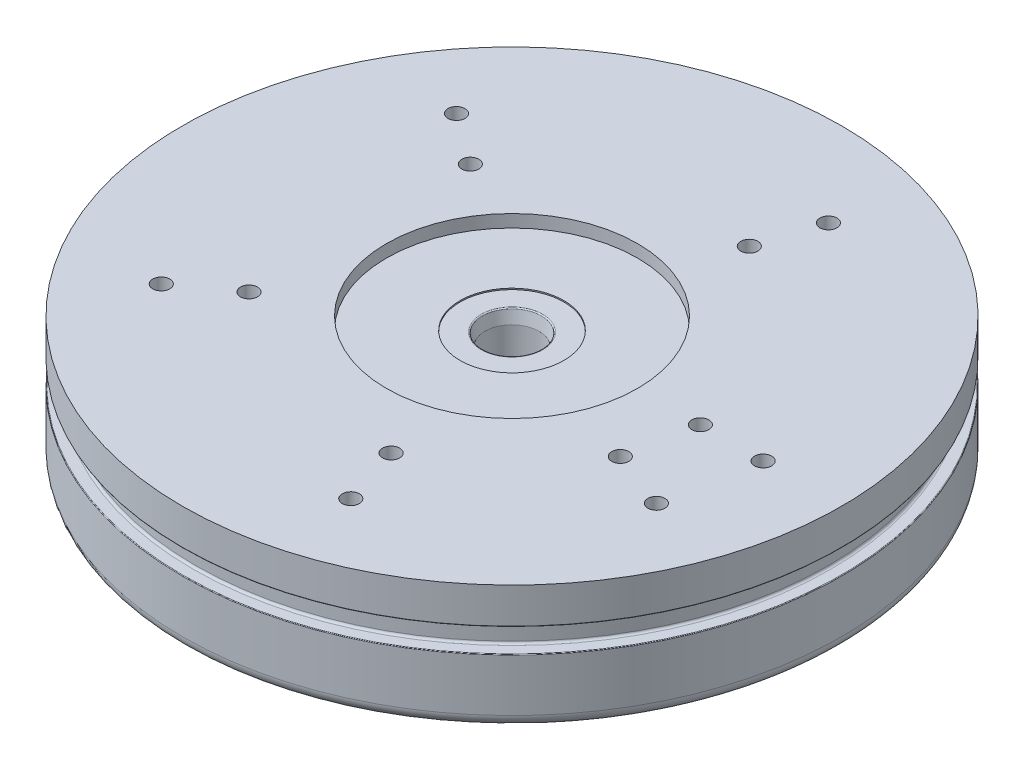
ISO-10303-21;
HEADER;
FILE_DESCRIPTION(('STEP AP214'),'2;1');
FILE_NAME('part.step','',(''),(''),'','','');
FILE_SCHEMA(('AUTOMOTIVE_DESIGN { 1 0 10303 214 1 1 1 1 }'));
ENDSEC;
DATA;
#1=APPLICATION_CONTEXT('core data for automotive mechanical design processes');
#2=APPLICATION_PROTOCOL_DEFINITION('international standard','automotive_design',2000,#1);
#3=PRODUCT_CONTEXT('',#1,'mechanical');
#4=PRODUCT('Part','Part','',(#3));
#5=PRODUCT_RELATED_PRODUCT_CATEGORY('part','',(#4));
#6=PRODUCT_DEFINITION_FORMATION('','',#4);
#7=PRODUCT_DEFINITION_CONTEXT('part definition',#1,'design');
#8=PRODUCT_DEFINITION('design','',#6,#7);
#9=PRODUCT_DEFINITION_SHAPE('','',#8);
#10=(LENGTH_UNIT() NAMED_UNIT(*) SI_UNIT(.MILLI.,.METRE.));
#11=(NAMED_UNIT(*) PLANE_ANGLE_UNIT() SI_UNIT($,.RADIAN.));
#12=(NAMED_UNIT(*) SI_UNIT($,.STERADIAN.) SOLID_ANGLE_UNIT());
#13=UNCERTAINTY_MEASURE_WITH_UNIT(LENGTH_MEASURE(1.E-05),#10,'distance_accuracy_value','');
#14=(GEOMETRIC_REPRESENTATION_CONTEXT(3) GLOBAL_UNCERTAINTY_ASSIGNED_CONTEXT((#13)) GLOBAL_UNIT_ASSIGNED_CONTEXT((#10,
#11,#12)) REPRESENTATION_CONTEXT('',''));
#15=CARTESIAN_POINT('',(0.,0.,0.));
#16=DIRECTION('',(0.,0.,1.));
#17=DIRECTION('',(1.,0.,0.));
#18=AXIS2_PLACEMENT_3D('',#15,#16,#17);
#19=CARTESIAN_POINT('',(-66.675,0.,0.));
#20=DIRECTION('',(0.,-1.,0.));
#21=DIRECTION('',(0.,0.,-1.));
#22=AXIS2_PLACEMENT_3D('',#19,#20,#21);
#23=PLANE('',#22);
#24=CARTESIAN_POINT('',(35.5694142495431,0.,13.6538188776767));
#25=DIRECTION('',(0.,1.,0.));
#26=DIRECTION('',(0.,0.,1.));
#27=AXIS2_PLACEMENT_3D('',#24,#25,#26);
#28=CIRCLE('',#27,1.72719999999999);
#29=CARTESIAN_POINT('',(35.5694142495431,0.,15.3810188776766));
#30=VERTEX_POINT('',#29);
#31=EDGE_CURVE('E94',#30,#30,#28,.T.);
#32=ORIENTED_EDGE('',*,*,#31,.F.);
#33=EDGE_LOOP('',(#32));
#34=FACE_BOUND('',#33,.T.);
#35=CARTESIAN_POINT('',(47.4258856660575,0.,18.2050918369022));
#36=DIRECTION('',(0.,1.,0.));
#37=DIRECTION('',(0.,0.,1.));
#38=AXIS2_PLACEMENT_3D('',#35,#36,#37);
#39=CIRCLE('',#38,1.72719999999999);
#40=CARTESIAN_POINT('',(47.4258856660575,0.,19.9322918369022));
#41=VERTEX_POINT('',#40);
#42=EDGE_CURVE('E93',#41,#41,#39,.T.);
#43=ORIENTED_EDGE('',*,*,#42,.F.);
#44=EDGE_LOOP('',(#43));
#45=FACE_BOUND('',#44,.T.);
#46=CARTESIAN_POINT('',(15.6980633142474,0.,-48.3136710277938));
#47=DIRECTION('',(0.,1.,0.));
#48=DIRECTION('',(0.,0.,1.));
#49=AXIS2_PLACEMENT_3D('',#46,#47,#48);
#50=CIRCLE('',#49,1.72719999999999);
#51=CARTESIAN_POINT('',(15.6980633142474,0.,-46.5864710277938));
#52=VERTEX_POINT('',#51);
#53=EDGE_CURVE('E110',#52,#52,#50,.T.);
#54=ORIENTED_EDGE('',*,*,#53,.F.);
#55=EDGE_LOOP('',(#54));
#56=FACE_BOUND('',#55,.T.);
#57=CARTESIAN_POINT('',(-30.8235474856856,0.,-22.3946181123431));
#58=DIRECTION('',(0.,1.,0.));
#59=DIRECTION('',(0.,0.,1.));
#60=AXIS2_PLACEMENT_3D('',#57,#58,#59);
#61=CIRCLE('',#60,1.72719999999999);
#62=CARTESIAN_POINT('',(-30.8235474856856,0.,-20.6674181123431));
#63=VERTEX_POINT('',#62);
#64=EDGE_CURVE('E116',#63,#63,#61,.T.);
#65=ORIENTED_EDGE('',*,*,#64,.F.);
#66=EDGE_LOOP('',(#65));
#67=FACE_BOUND('',#66,.T.);
#68=CARTESIAN_POINT('',(-41.0980633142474,0.,-29.8594908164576));
#69=DIRECTION('',(0.,1.,0.));
#70=DIRECTION('',(0.,0.,1.));
#71=AXIS2_PLACEMENT_3D('',#68,#69,#70);
#72=CIRCLE('',#71,1.72719999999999);
#73=CARTESIAN_POINT('',(-41.0980633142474,0.,-28.1322908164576));
#74=VERTEX_POINT('',#73);
#75=EDGE_CURVE('E122',#74,#74,#72,.T.);
#76=ORIENTED_EDGE('',*,*,#75,.F.);
#77=EDGE_LOOP('',(#76));
#78=FACE_BOUND('',#77,.T.);
#79=CARTESIAN_POINT('',(-30.8235474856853,0.,22.3946181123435));
#80=DIRECTION('',(0.,1.,0.));
#81=DIRECTION('',(0.,0.,1.));
#82=AXIS2_PLACEMENT_3D('',#79,#80,#81);
#83=CIRCLE('',#82,1.72719999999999);
#84=CARTESIAN_POINT('',(-30.8235474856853,0.,24.1218181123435));
#85=VERTEX_POINT('',#84);
#86=EDGE_CURVE('E128',#85,#85,#83,.T.);
#87=ORIENTED_EDGE('',*,*,#86,.F.);
#88=EDGE_LOOP('',(#87));
#89=FACE_BOUND('',#88,.T.);
#90=CARTESIAN_POINT('',(-41.0980633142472,0.,29.8594908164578));
#91=DIRECTION('',(0.,1.,0.));
#92=DIRECTION('',(0.,0.,1.));
#93=AXIS2_PLACEMENT_3D('',#90,#91,#92);
#94=CIRCLE('',#93,1.72719999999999);
#95=CARTESIAN_POINT('',(-41.0980633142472,0.,31.5866908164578));
#96=VERTEX_POINT('',#95);
#97=EDGE_CURVE('E134',#96,#96,#94,.T.);
#98=ORIENTED_EDGE('',*,*,#97,.F.);
#99=EDGE_LOOP('',(#98));
#100=FACE_BOUND('',#99,.T.);
#101=CARTESIAN_POINT('',(11.7735474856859,0.,36.2352532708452));
#102=DIRECTION('',(0.,1.,0.));
#103=DIRECTION('',(0.,0.,1.));
#104=AXIS2_PLACEMENT_3D('',#101,#102,#103);
#105=CIRCLE('',#104,1.72719999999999);
#106=CARTESIAN_POINT('',(11.7735474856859,0.,37.9624532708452));
#107=VERTEX_POINT('',#106);
#108=EDGE_CURVE('E140',#107,#107,#105,.T.);
#109=ORIENTED_EDGE('',*,*,#108,.F.);
#110=EDGE_LOOP('',(#109));
#111=FACE_BOUND('',#110,.T.);
#112=CARTESIAN_POINT('',(15.6980633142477,0.,48.3136710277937));
#113=DIRECTION('',(0.,1.,0.));
#114=DIRECTION('',(0.,0.,1.));
#115=AXIS2_PLACEMENT_3D('',#112,#113,#114);
#116=CIRCLE('',#115,1.72719999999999);
#117=CARTESIAN_POINT('',(15.6980633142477,0.,50.0408710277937));
#118=VERTEX_POINT('',#117);
#119=EDGE_CURVE('E146',#118,#118,#116,.T.);
#120=ORIENTED_EDGE('',*,*,#119,.F.);
#121=EDGE_LOOP('',(#120));
#122=FACE_BOUND('',#121,.T.);
#123=CARTESIAN_POINT('',(38.1,0.,-5.24735660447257E-13));
#124=DIRECTION('',(0.,1.,0.));
#125=DIRECTION('',(0.,0.,1.));
#126=AXIS2_PLACEMENT_3D('',#123,#124,#125);
#127=CIRCLE('',#126,1.72719999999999);
#128=CARTESIAN_POINT('',(38.1,0.,1.72719999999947));
#129=VERTEX_POINT('',#128);
#130=EDGE_CURVE('E152',#129,#129,#127,.T.);
#131=ORIENTED_EDGE('',*,*,#130,.F.);
#132=EDGE_LOOP('',(#131));
#133=FACE_BOUND('',#132,.T.);
#134=CARTESIAN_POINT('',(50.8,0.,-5.21266213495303E-13));
#135=DIRECTION('',(0.,1.,0.));
#136=DIRECTION('',(0.,0.,1.));
#137=AXIS2_PLACEMENT_3D('',#134,#135,#136);
#138=CIRCLE('',#137,1.72719999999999);
#139=CARTESIAN_POINT('',(50.8,0.,1.72719999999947));
#140=VERTEX_POINT('',#139);
#141=EDGE_CURVE('E158',#140,#140,#138,.T.);
#142=ORIENTED_EDGE('',*,*,#141,.F.);
#143=EDGE_LOOP('',(#142));
#144=FACE_BOUND('',#143,.T.);
#145=CARTESIAN_POINT('',(0.,0.,0.));
#146=DIRECTION('',(0.,1.,0.));
#147=DIRECTION('',(0.,0.,1.));
#148=AXIS2_PLACEMENT_3D('',#145,#146,#147);
#149=CIRCLE('',#148,25.4);
#150=CARTESIAN_POINT('',(0.,0.,25.4));
#151=VERTEX_POINT('',#150);
#152=EDGE_CURVE('E186',#151,#151,#149,.T.);
#153=ORIENTED_EDGE('',*,*,#152,.F.);
#154=EDGE_LOOP('',(#153));
#155=FACE_BOUND('',#154,.T.);
#156=CARTESIAN_POINT('',(0.,0.,0.));
#157=DIRECTION('',(0.,-1.,0.));
#158=DIRECTION('',(0.,0.,-1.));
#159=AXIS2_PLACEMENT_3D('',#156,#157,#158);
#160=CIRCLE('',#159,66.675);
#161=CARTESIAN_POINT('',(0.,0.,-66.675));
#162=VERTEX_POINT('',#161);
#163=EDGE_CURVE('E209',#162,#162,#160,.T.);
#164=ORIENTED_EDGE('',*,*,#163,.F.);
#165=EDGE_LOOP('',(#164));
#166=FACE_BOUND('',#165,.T.);
#167=CARTESIAN_POINT('',(11.7735474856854,0.,-36.2352532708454));
#168=DIRECTION('',(0.,1.,0.));
#169=DIRECTION('',(0.,0.,1.));
#170=AXIS2_PLACEMENT_3D('',#167,#168,#169);
#171=CIRCLE('',#170,1.72719999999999);
#172=CARTESIAN_POINT('',(11.7735474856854,0.,-34.5080532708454));
#173=VERTEX_POINT('',#172);
#174=EDGE_CURVE('E104',#173,#173,#171,.T.);
#175=ORIENTED_EDGE('',*,*,#174,.F.);
#176=EDGE_LOOP('',(#175));
#177=FACE_BOUND('',#176,.T.);
#178=ADVANCED_FACE('F37',(#34,#45,#56,#67,#78,#89,#100,#111,#122,#133,#144,#155,#166,#177),#23,.F.);
#179=CARTESIAN_POINT('',(0.,-12.2682,0.));
#180=DIRECTION('',(0.,-1.,0.));
#181=DIRECTION('',(0.,0.,-1.));
#182=AXIS2_PLACEMENT_3D('',#179,#180,#181);
#183=TOROIDAL_SURFACE('',#182,66.548,0.127000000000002);
#184=CARTESIAN_POINT('',(0.,-12.2682,0.));
#185=DIRECTION('',(0.,-1.,0.));
#186=DIRECTION('',(0.,0.,-1.));
#187=AXIS2_PLACEMENT_3D('',#184,#185,#186);
#188=CIRCLE('',#187,66.675);
#189=CARTESIAN_POINT('',(0.,-12.2682,-66.675));
#190=VERTEX_POINT('',#189);
#191=EDGE_CURVE('E215',#190,#190,#188,.T.);
#192=ORIENTED_EDGE('',*,*,#191,.F.);
#193=EDGE_LOOP('',(#192));
#194=FACE_BOUND('',#193,.T.);
#195=CARTESIAN_POINT('',(0.,-12.1412,0.));
#196=DIRECTION('',(0.,-1.,0.));
#197=DIRECTION('',(0.,0.,-1.));
#198=AXIS2_PLACEMENT_3D('',#195,#196,#197);
#199=CIRCLE('',#198,66.548);
#200=CARTESIAN_POINT('',(0.,-12.1412,-66.548));
#201=VERTEX_POINT('',#200);
#202=EDGE_CURVE('E185',#201,#201,#199,.T.);
#203=ORIENTED_EDGE('',*,*,#202,.T.);
#204=EDGE_LOOP('',(#203));
#205=FACE_BOUND('',#204,.T.);
#206=ADVANCED_FACE('F240',(#194,#205),#183,.T.);
#207=CARTESIAN_POINT('',(0.,-12.7,0.));
#208=DIRECTION('',(0.,-1.,0.));
#209=DIRECTION('',(0.,0.,-1.));
#210=AXIS2_PLACEMENT_3D('',#207,#208,#209);
#211=CYLINDRICAL_SURFACE('',#210,66.675);
#212=CARTESIAN_POINT('',(0.,-22.86,0.));
#213=DIRECTION('',(0.,1.,0.));
#214=DIRECTION('',(0.,0.,1.));
#215=AXIS2_PLACEMENT_3D('',#212,#213,#214);
#216=CIRCLE('',#215,66.675);
#217=CARTESIAN_POINT('',(0.,-22.86,66.675));
#218=VERTEX_POINT('',#217);
#219=EDGE_CURVE('E11',#218,#218,#216,.T.);
#220=ORIENTED_EDGE('',*,*,#219,.T.);
#221=EDGE_LOOP('',(#220));
#222=FACE_BOUND('',#221,.T.);
#223=ORIENTED_EDGE('',*,*,#191,.T.);
#224=EDGE_LOOP('',(#223));
#225=FACE_BOUND('',#224,.T.);
#226=ADVANCED_FACE('F246',(#222,#225),#211,.T.);
#227=CARTESIAN_POINT('',(-66.675,-25.4,0.));
#228=DIRECTION('',(0.,1.,0.));
#229=DIRECTION('',(0.,0.,1.));
#230=AXIS2_PLACEMENT_3D('',#227,#228,#229);
#231=PLANE('',#230);
#232=CARTESIAN_POINT('',(0.,-25.4,0.));
#233=DIRECTION('',(0.,1.,0.));
#234=DIRECTION('',(0.,0.,1.));
#235=AXIS2_PLACEMENT_3D('',#232,#233,#234);
#236=CIRCLE('',#235,64.135);
#237=CARTESIAN_POINT('',(0.,-25.4,64.135));
#238=VERTEX_POINT('',#237);
#239=EDGE_CURVE('E46',#238,#238,#236,.F.);
#240=ORIENTED_EDGE('',*,*,#239,.T.);
#241=EDGE_LOOP('',(#240));
#242=FACE_BOUND('',#241,.T.);
#243=CARTESIAN_POINT('',(0.,-25.4,0.));
#244=DIRECTION('',(0.,-1.,0.));
#245=DIRECTION('',(0.,0.,-1.));
#246=AXIS2_PLACEMENT_3D('',#243,#244,#245);
#247=CIRCLE('',#246,53.975);
#248=CARTESIAN_POINT('',(0.,-25.4,-53.975));
#249=VERTEX_POINT('',#248);
#250=EDGE_CURVE('E212',#249,#249,#247,.T.);
#251=ORIENTED_EDGE('',*,*,#250,.F.);
#252=EDGE_LOOP('',(#251));
#253=FACE_BOUND('',#252,.T.);
#254=ADVANCED_FACE('F221',(#242,#253),#231,.F.);
#255=CARTESIAN_POINT('',(0.,-25.4,0.));
#256=DIRECTION('',(0.,-1.,0.));
#257=DIRECTION('',(0.,0.,-1.));
#258=AXIS2_PLACEMENT_3D('',#255,#256,#257);
#259=CONICAL_SURFACE('',#258,53.975,1.339705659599);
#260=CARTESIAN_POINT('',(0.,-14.0073529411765,0.));
#261=DIRECTION('',(0.,-1.,0.));
#262=DIRECTION('',(0.,0.,-1.));
#263=AXIS2_PLACEMENT_3D('',#260,#261,#262);
#264=CIRCLE('',#263,5.55625);
#265=CARTESIAN_POINT('',(0.,-14.0073529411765,-5.55625000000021));
#266=VERTEX_POINT('',#265);
#267=EDGE_CURVE('E41',#266,#266,#264,.F.);
#268=CARTESIAN_POINT('',(0.,-14.0073529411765,-5.55625000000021));
#269=CARTESIAN_POINT('',(0.,-14.1260263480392,-6.06061197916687));
#270=CARTESIAN_POINT('',(0.,-14.244699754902,-6.56497395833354));
#271=CARTESIAN_POINT('',(0.,-14.4820465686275,-7.57369791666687));
#272=CARTESIAN_POINT('',(0.,-14.6007199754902,-8.07805989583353));
#273=CARTESIAN_POINT('',(0.,-14.8380667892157,-9.08678385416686));
#274=CARTESIAN_POINT('',(0.,-14.9567401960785,-9.59114583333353));
#275=CARTESIAN_POINT('',(0.,-15.1940870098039,-10.5998697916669));
#276=CARTESIAN_POINT('',(0.,-15.3127604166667,-11.1042317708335));
#277=CARTESIAN_POINT('',(0.,-15.5501072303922,-12.1129557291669));
#278=CARTESIAN_POINT('',(0.,-15.6687806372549,-12.6173177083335));
#279=CARTESIAN_POINT('',(0.,-15.9061274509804,-13.6260416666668));
#280=CARTESIAN_POINT('',(0.,-16.0248008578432,-14.1304036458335));
#281=CARTESIAN_POINT('',(0.,-16.2621476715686,-15.1391276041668));
#282=CARTESIAN_POINT('',(0.,-16.3808210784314,-15.6434895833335));
#283=CARTESIAN_POINT('',(0.,-16.6181678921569,-16.6522135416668));
#284=CARTESIAN_POINT('',(0.,-16.7368412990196,-17.1565755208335));
#285=CARTESIAN_POINT('',(0.,-16.9741881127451,-18.1652994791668));
#286=CARTESIAN_POINT('',(0.,-17.0928615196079,-18.6696614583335));
#287=CARTESIAN_POINT('',(0.,-17.3302083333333,-19.6783854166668));
#288=CARTESIAN_POINT('',(0.,-17.4488817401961,-20.1827473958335));
#289=CARTESIAN_POINT('',(0.,-17.6862285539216,-21.1914713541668));
#290=CARTESIAN_POINT('',(0.,-17.8049019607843,-21.6958333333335));
#291=CARTESIAN_POINT('',(0.,-18.0422487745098,-22.7045572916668));
#292=CARTESIAN_POINT('',(0.,-18.1609221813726,-23.2089192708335));
#293=CARTESIAN_POINT('',(0.,-18.398268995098,-24.2176432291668));
#294=CARTESIAN_POINT('',(0.,-18.5169424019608,-24.7220052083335));
#295=CARTESIAN_POINT('',(0.,-18.7542892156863,-25.7307291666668));
#296=CARTESIAN_POINT('',(0.,-18.872962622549,-26.2350911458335));
#297=CARTESIAN_POINT('',(0.,-19.1103094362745,-27.2438151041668));
#298=CARTESIAN_POINT('',(0.,-19.2289828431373,-27.7481770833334));
#299=CARTESIAN_POINT('',(0.,-19.4663296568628,-28.7569010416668));
#300=CARTESIAN_POINT('',(0.,-19.5850030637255,-29.2612630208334));
#301=CARTESIAN_POINT('',(0.,-19.822349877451,-30.2699869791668));
#302=CARTESIAN_POINT('',(0.,-19.9410232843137,-30.7743489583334));
#303=CARTESIAN_POINT('',(0.,-20.1783700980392,-31.7830729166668));
#304=CARTESIAN_POINT('',(0.,-20.297043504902,-32.2874348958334));
#305=CARTESIAN_POINT('',(0.,-20.5343903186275,-33.2961588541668));
#306=CARTESIAN_POINT('',(0.,-20.6530637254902,-33.8005208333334));
#307=CARTESIAN_POINT('',(0.,-20.8904105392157,-34.8092447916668));
#308=CARTESIAN_POINT('',(0.,-21.0090839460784,-35.3136067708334));
#309=CARTESIAN_POINT('',(0.,-21.2464307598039,-36.3223307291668));
#310=CARTESIAN_POINT('',(0.,-21.3651041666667,-36.8266927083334));
#311=CARTESIAN_POINT('',(0.,-21.6024509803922,-37.8354166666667));
#312=CARTESIAN_POINT('',(0.,-21.7211243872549,-38.3397786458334));
#313=CARTESIAN_POINT('',(0.,-21.9584712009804,-39.3485026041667));
#314=CARTESIAN_POINT('',(0.,-22.0771446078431,-39.8528645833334));
#315=CARTESIAN_POINT('',(0.,-22.3144914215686,-40.8615885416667));
#316=CARTESIAN_POINT('',(0.,-22.4331648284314,-41.3659505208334));
#317=CARTESIAN_POINT('',(0.,-22.6705116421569,-42.3746744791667));
#318=CARTESIAN_POINT('',(0.,-22.7891850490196,-42.8790364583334));
#319=CARTESIAN_POINT('',(0.,-23.0265318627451,-43.8877604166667));
#320=CARTESIAN_POINT('',(0.,-23.1452052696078,-44.3921223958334));
#321=CARTESIAN_POINT('',(0.,-23.3825520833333,-45.4008463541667));
#322=CARTESIAN_POINT('',(0.,-23.5012254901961,-45.9052083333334));
#323=CARTESIAN_POINT('',(0.,-23.7385723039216,-46.9139322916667));
#324=CARTESIAN_POINT('',(0.,-23.8572457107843,-47.4182942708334));
#325=CARTESIAN_POINT('',(0.,-24.0945925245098,-48.4270182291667));
#326=CARTESIAN_POINT('',(0.,-24.2132659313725,-48.9313802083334));
#327=CARTESIAN_POINT('',(0.,-24.450612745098,-49.9401041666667));
#328=CARTESIAN_POINT('',(0.,-24.5692861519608,-50.4444661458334));
#329=CARTESIAN_POINT('',(0.,-24.8066329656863,-51.4531901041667));
#330=CARTESIAN_POINT('',(0.,-24.925306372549,-51.9575520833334));
#331=CARTESIAN_POINT('',(0.,-25.1626531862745,-52.9662760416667));
#332=CARTESIAN_POINT('',(0.,-25.2813265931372,-53.4706380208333));
#333=CARTESIAN_POINT('',(0.,-25.4,-53.975));
#334=B_SPLINE_CURVE_WITH_KNOTS('',3,(#268,#269,#270,#271,#272,#273,#274,#275,#276,#277,#278,
#279,#280,#281,#282,#283,#284,#285,#286,#287,#288,#289,#290,#291,#292,#293,#294,#295,#296,#297,
#298,#299,#300,#301,#302,#303,#304,#305,#306,#307,#308,#309,#310,#311,#312,#313,#314,#315,#316,
#317,#318,#319,#320,#321,#322,#323,#324,#325,#326,#327,#328,#329,#330,#331,#332,#333),
.UNSPECIFIED.,.F.,.F.,(4,2,2,2,2,2,2,2,2,2,2,2,2,2,2,2,2,2,2,2,2,2,2,2,2,2,2,2,2,2,2,2,4),(0.,
1.55440646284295,3.1088129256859,4.66321938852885,6.2176258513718,7.77203231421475,
9.3264387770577,10.8808452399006,12.4352517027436,13.9896581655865,15.5440646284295,
17.0984710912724,18.6528775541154,20.2072840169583,21.7616904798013,23.3160969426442,
24.8705034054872,26.4249098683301,27.9793163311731,29.533722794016,31.088129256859,
32.6425357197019,34.1969421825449,35.7513486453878,37.3057551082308,38.8601615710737,
40.4145680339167,41.9689744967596,43.5233809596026,45.0777874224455,46.6321938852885,
48.1866003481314,49.7410068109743),.UNSPECIFIED.);
#335=EDGE_CURVE('BSEAM254',#266,#249,#334,.T.);
#336=ORIENTED_EDGE('',*,*,#267,.T.);
#337=ORIENTED_EDGE('',*,*,#250,.T.);
#338=ORIENTED_EDGE('',*,*,#335,.T.);
#339=ORIENTED_EDGE('',*,*,#335,.F.);
#340=EDGE_LOOP('',(#336,#338,#337,#339));
#341=FACE_BOUND('',#340,.T.);
#342=ADVANCED_FACE('F254',(#341),#259,.F.);
#343=CARTESIAN_POINT('',(0.,-12.7,0.));
#344=DIRECTION('',(0.,-1.,0.));
#345=DIRECTION('',(0.,0.,-1.));
#346=AXIS2_PLACEMENT_3D('',#343,#344,#345);
#347=CYLINDRICAL_SURFACE('',#346,66.675);
#348=CARTESIAN_POINT('',(0.,-7.18819999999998,0.));
#349=DIRECTION('',(0.,-1.,0.));
#350=DIRECTION('',(0.,0.,-1.));
#351=AXIS2_PLACEMENT_3D('',#348,#349,#350);
#352=CIRCLE('',#351,66.675);
#353=CARTESIAN_POINT('',(0.,-7.18819999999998,-66.675));
#354=VERTEX_POINT('',#353);
#355=EDGE_CURVE('E206',#354,#354,#352,.T.);
#356=ORIENTED_EDGE('',*,*,#355,.F.);
#357=EDGE_LOOP('',(#356));
#358=FACE_BOUND('',#357,.T.);
#359=ORIENTED_EDGE('',*,*,#163,.T.);
#360=EDGE_LOOP('',(#359));
#361=FACE_BOUND('',#360,.T.);
#362=ADVANCED_FACE('F252',(#358,#361),#347,.T.);
#363=CARTESIAN_POINT('',(0.,-7.18819999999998,0.));
#364=DIRECTION('',(0.,-1.,0.));
#365=DIRECTION('',(0.,0.,-1.));
#366=AXIS2_PLACEMENT_3D('',#363,#364,#365);
#367=TOROIDAL_SURFACE('',#366,66.548,0.127);
#368=CARTESIAN_POINT('',(0.,-7.31520000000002,0.));
#369=DIRECTION('',(0.,-1.,0.));
#370=DIRECTION('',(0.,0.,-1.));
#371=AXIS2_PLACEMENT_3D('',#368,#369,#370);
#372=CIRCLE('',#371,66.548);
#373=CARTESIAN_POINT('',(0.,-7.31520000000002,-66.548));
#374=VERTEX_POINT('',#373);
#375=EDGE_CURVE('E203',#374,#374,#372,.T.);
#376=ORIENTED_EDGE('',*,*,#375,.F.);
#377=EDGE_LOOP('',(#376));
#378=FACE_BOUND('',#377,.T.);
#379=ORIENTED_EDGE('',*,*,#355,.T.);
#380=EDGE_LOOP('',(#379));
#381=FACE_BOUND('',#380,.T.);
#382=ADVANCED_FACE('F291',(#378,#381),#367,.T.);
#383=CARTESIAN_POINT('',(-64.4779,-7.31519999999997,0.));
#384=DIRECTION('',(0.,1.,0.));
#385=DIRECTION('',(0.,0.,1.));
#386=AXIS2_PLACEMENT_3D('',#383,#384,#385);
#387=PLANE('',#386);
#388=CARTESIAN_POINT('',(0.,-7.31519999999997,0.));
#389=DIRECTION('',(0.,-1.,0.));
#390=DIRECTION('',(0.,0.,-1.));
#391=AXIS2_PLACEMENT_3D('',#388,#389,#390);
#392=CIRCLE('',#391,64.4779);
#393=CARTESIAN_POINT('',(0.,-7.31519999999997,-64.4779));
#394=VERTEX_POINT('',#393);
#395=EDGE_CURVE('E200',#394,#394,#392,.T.);
#396=ORIENTED_EDGE('',*,*,#395,.F.);
#397=EDGE_LOOP('',(#396));
#398=FACE_BOUND('',#397,.T.);
#399=ORIENTED_EDGE('',*,*,#375,.T.);
#400=EDGE_LOOP('',(#399));
#401=FACE_BOUND('',#400,.T.);
#402=ADVANCED_FACE('F285',(#398,#401),#387,.F.);
#403=CARTESIAN_POINT('',(0.,-7.75969999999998,0.));
#404=DIRECTION('',(0.,-1.,0.));
#405=DIRECTION('',(0.,0.,-1.));
#406=AXIS2_PLACEMENT_3D('',#403,#404,#405);
#407=TOROIDAL_SURFACE('',#406,64.4779,0.444500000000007);
#408=CARTESIAN_POINT('',(0.,-7.75969999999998,0.));
#409=DIRECTION('',(0.,-1.,0.));
#410=DIRECTION('',(0.,0.,-1.));
#411=AXIS2_PLACEMENT_3D('',#408,#409,#410);
#412=CIRCLE('',#411,64.0334);
#413=CARTESIAN_POINT('',(0.,-7.75969999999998,-64.0334));
#414=VERTEX_POINT('',#413);
#415=EDGE_CURVE('E197',#414,#414,#412,.T.);
#416=ORIENTED_EDGE('',*,*,#415,.F.);
#417=EDGE_LOOP('',(#416));
#418=FACE_BOUND('',#417,.T.);
#419=ORIENTED_EDGE('',*,*,#395,.T.);
#420=EDGE_LOOP('',(#419));
#421=FACE_BOUND('',#420,.T.);
#422=ADVANCED_FACE('F279',(#418,#421),#407,.F.);
#423=CARTESIAN_POINT('',(0.,-12.7,0.));
#424=DIRECTION('',(0.,-1.,0.));
#425=DIRECTION('',(0.,0.,-1.));
#426=AXIS2_PLACEMENT_3D('',#423,#424,#425);
#427=CYLINDRICAL_SURFACE('',#426,64.0334);
#428=CARTESIAN_POINT('',(0.,-11.6967,0.));
#429=DIRECTION('',(0.,-1.,0.));
#430=DIRECTION('',(0.,0.,-1.));
#431=AXIS2_PLACEMENT_3D('',#428,#429,#430);
#432=CIRCLE('',#431,64.0334);
#433=CARTESIAN_POINT('',(0.,-11.6967,-64.0334));
#434=VERTEX_POINT('',#433);
#435=EDGE_CURVE('E194',#434,#434,#432,.T.);
#436=ORIENTED_EDGE('',*,*,#435,.F.);
#437=EDGE_LOOP('',(#436));
#438=FACE_BOUND('',#437,.T.);
#439=ORIENTED_EDGE('',*,*,#415,.T.);
#440=EDGE_LOOP('',(#439));
#441=FACE_BOUND('',#440,.T.);
#442=ADVANCED_FACE('F273',(#438,#441),#427,.T.);
#443=CARTESIAN_POINT('',(0.,-11.6967,0.));
#444=DIRECTION('',(0.,-1.,0.));
#445=DIRECTION('',(0.,0.,-1.));
#446=AXIS2_PLACEMENT_3D('',#443,#444,#445);
#447=TOROIDAL_SURFACE('',#446,64.4779,0.444500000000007);
#448=CARTESIAN_POINT('',(0.,-12.1412,0.));
#449=DIRECTION('',(0.,-1.,0.));
#450=DIRECTION('',(0.,0.,-1.));
#451=AXIS2_PLACEMENT_3D('',#448,#449,#450);
#452=CIRCLE('',#451,64.4779);
#453=CARTESIAN_POINT('',(0.,-12.1412,-64.4779));
#454=VERTEX_POINT('',#453);
#455=EDGE_CURVE('E191',#454,#454,#452,.T.);
#456=ORIENTED_EDGE('',*,*,#455,.F.);
#457=EDGE_LOOP('',(#456));
#458=FACE_BOUND('',#457,.T.);
#459=ORIENTED_EDGE('',*,*,#435,.T.);
#460=EDGE_LOOP('',(#459));
#461=FACE_BOUND('',#460,.T.);
#462=ADVANCED_FACE('F235',(#458,#461),#447,.F.);
#463=CARTESIAN_POINT('',(-64.4779,-12.1412,0.));
#464=DIRECTION('',(0.,-1.,0.));
#465=DIRECTION('',(0.,0.,-1.));
#466=AXIS2_PLACEMENT_3D('',#463,#464,#465);
#467=PLANE('',#466);
#468=ORIENTED_EDGE('',*,*,#202,.F.);
#469=EDGE_LOOP('',(#468));
#470=FACE_BOUND('',#469,.T.);
#471=ORIENTED_EDGE('',*,*,#455,.T.);
#472=EDGE_LOOP('',(#471));
#473=FACE_BOUND('',#472,.T.);
#474=ADVANCED_FACE('F226',(#470,#473),#467,.F.);
#475=CARTESIAN_POINT('',(0.,-22.86,0.));
#476=DIRECTION('',(0.,1.,0.));
#477=DIRECTION('',(0.,0.,1.));
#478=AXIS2_PLACEMENT_3D('',#475,#476,#477);
#479=TOROIDAL_SURFACE('',#478,64.135,2.54);
#480=ORIENTED_EDGE('',*,*,#219,.F.);
#481=EDGE_LOOP('',(#480));
#482=FACE_BOUND('',#481,.T.);
#483=ORIENTED_EDGE('',*,*,#239,.F.);
#484=EDGE_LOOP('',(#483));
#485=FACE_BOUND('',#484,.T.);
#486=ADVANCED_FACE('F39',(#482,#485),#479,.T.);
#487=CARTESIAN_POINT('',(0.,-2.53999999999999,0.));
#488=DIRECTION('',(0.,1.,0.));
#489=DIRECTION('',(0.,0.,1.));
#490=AXIS2_PLACEMENT_3D('',#487,#488,#489);
#491=CYLINDRICAL_SURFACE('',#490,25.4);
#492=CARTESIAN_POINT('',(0.,-2.53999999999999,0.));
#493=DIRECTION('',(0.,1.,0.));
#494=DIRECTION('',(0.,0.,1.));
#495=AXIS2_PLACEMENT_3D('',#492,#493,#494);
#496=CIRCLE('',#495,25.4);
#497=CARTESIAN_POINT('',(0.,-2.53999999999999,25.4));
#498=VERTEX_POINT('',#497);
#499=EDGE_CURVE('E182',#498,#498,#496,.T.);
#500=ORIENTED_EDGE('',*,*,#499,.F.);
#501=EDGE_LOOP('',(#500));
#502=FACE_BOUND('',#501,.T.);
#503=ORIENTED_EDGE('',*,*,#152,.T.);
#504=EDGE_LOOP('',(#503));
#505=FACE_BOUND('',#504,.T.);
#506=ADVANCED_FACE('F225',(#502,#505),#491,.F.);
#507=CARTESIAN_POINT('',(0.,-2.53999999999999,0.));
#508=DIRECTION('',(0.,1.,0.));
#509=DIRECTION('',(0.,0.,1.));
#510=AXIS2_PLACEMENT_3D('',#507,#508,#509);
#511=PLANE('',#510);
#512=CARTESIAN_POINT('',(0.,-2.53999999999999,0.));
#513=DIRECTION('',(0.,1.,0.));
#514=DIRECTION('',(0.,0.,1.));
#515=AXIS2_PLACEMENT_3D('',#512,#513,#514);
#516=CIRCLE('',#515,10.5);
#517=CARTESIAN_POINT('',(0.,-2.53999999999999,10.5));
#518=VERTEX_POINT('',#517);
#519=EDGE_CURVE('E179',#518,#518,#516,.T.);
#520=ORIENTED_EDGE('',*,*,#519,.F.);
#521=EDGE_LOOP('',(#520));
#522=FACE_BOUND('',#521,.T.);
#523=ORIENTED_EDGE('',*,*,#499,.T.);
#524=EDGE_LOOP('',(#523));
#525=FACE_BOUND('',#524,.T.);
#526=ADVANCED_FACE('F232',(#522,#525),#511,.T.);
#527=CARTESIAN_POINT('',(0.,-2.53999999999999,0.));
#528=DIRECTION('',(0.,1.,0.));
#529=DIRECTION('',(0.,0.,1.));
#530=AXIS2_PLACEMENT_3D('',#527,#528,#529);
#531=CYLINDRICAL_SURFACE('',#530,5.55625);
#532=CARTESIAN_POINT('',(0.,-5.30441779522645,0.));
#533=DIRECTION('',(0.,1.,0.));
#534=DIRECTION('',(0.,0.,1.));
#535=AXIS2_PLACEMENT_3D('',#532,#533,#534);
#536=CIRCLE('',#535,5.55625);
#537=CARTESIAN_POINT('',(0.,-5.30441779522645,5.55625));
#538=VERTEX_POINT('',#537);
#539=EDGE_CURVE('E164',#538,#538,#536,.T.);
#540=ORIENTED_EDGE('',*,*,#539,.T.);
#541=EDGE_LOOP('',(#540));
#542=FACE_BOUND('',#541,.T.);
#543=ORIENTED_EDGE('',*,*,#267,.F.);
#544=EDGE_LOOP('',(#543));
#545=FACE_BOUND('',#544,.T.);
#546=ADVANCED_FACE('F394',(#542,#545),#531,.F.);
#547=CARTESIAN_POINT('',(0.,-2.53999999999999,0.));
#548=DIRECTION('',(0.,1.,0.));
#549=DIRECTION('',(0.,0.,1.));
#550=AXIS2_PLACEMENT_3D('',#547,#548,#549);
#551=CYLINDRICAL_SURFACE('',#550,10.5);
#552=CARTESIAN_POINT('',(0.,-2.79400000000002,0.));
#553=DIRECTION('',(0.,1.,0.));
#554=DIRECTION('',(0.,0.,1.));
#555=AXIS2_PLACEMENT_3D('',#552,#553,#554);
#556=CIRCLE('',#555,10.5);
#557=CARTESIAN_POINT('',(0.,-2.79400000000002,10.5));
#558=VERTEX_POINT('',#557);
#559=EDGE_CURVE('E176',#558,#558,#556,.T.);
#560=ORIENTED_EDGE('',*,*,#559,.F.);
#561=EDGE_LOOP('',(#560));
#562=FACE_BOUND('',#561,.T.);
#563=ORIENTED_EDGE('',*,*,#519,.T.);
#564=EDGE_LOOP('',(#563));
#565=FACE_BOUND('',#564,.T.);
#566=ADVANCED_FACE('F397',(#562,#565),#551,.F.);
#567=CARTESIAN_POINT('',(-6.22499116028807,-2.79400000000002,-0.0104906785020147));
#568=DIRECTION('',(0.,-1.,0.));
#569=DIRECTION('',(0.,0.,-1.));
#570=AXIS2_PLACEMENT_3D('',#567,#568,#569);
#571=PLANE('',#570);
#572=CARTESIAN_POINT('',(0.,-2.79400000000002,0.));
#573=DIRECTION('',(0.,1.,0.));
#574=DIRECTION('',(0.,0.,1.));
#575=AXIS2_PLACEMENT_3D('',#572,#573,#574);
#576=CIRCLE('',#575,6.225);
#577=CARTESIAN_POINT('',(0.,-2.79400000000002,6.225));
#578=VERTEX_POINT('',#577);
#579=EDGE_CURVE('E173',#578,#578,#576,.T.);
#580=ORIENTED_EDGE('',*,*,#579,.F.);
#581=EDGE_LOOP('',(#580));
#582=FACE_BOUND('',#581,.T.);
#583=ORIENTED_EDGE('',*,*,#559,.T.);
#584=EDGE_LOOP('',(#583));
#585=FACE_BOUND('',#584,.T.);
#586=ADVANCED_FACE('F409',(#582,#585),#571,.F.);
#587=CARTESIAN_POINT('',(0.,-3.048,0.));
#588=DIRECTION('',(0.,1.,0.));
#589=DIRECTION('',(0.,0.,1.));
#590=AXIS2_PLACEMENT_3D('',#587,#588,#589);
#591=TOROIDAL_SURFACE('',#590,6.225,0.254);
#592=CARTESIAN_POINT('',(0.,-2.99519043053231,0.));
#593=DIRECTION('',(0.,1.,0.));
#594=DIRECTION('',(0.,0.,1.));
#595=AXIS2_PLACEMENT_3D('',#592,#593,#594);
#596=CIRCLE('',#595,5.97655050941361);
#597=CARTESIAN_POINT('',(0.,-2.99519043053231,5.97655050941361));
#598=VERTEX_POINT('',#597);
#599=EDGE_CURVE('E170',#598,#598,#596,.T.);
#600=ORIENTED_EDGE('',*,*,#599,.F.);
#601=EDGE_LOOP('',(#600));
#602=FACE_BOUND('',#601,.T.);
#603=ORIENTED_EDGE('',*,*,#579,.T.);
#604=EDGE_LOOP('',(#603));
#605=FACE_BOUND('',#604,.T.);
#606=ADVANCED_FACE('F405',(#602,#605),#591,.T.);
#607=CARTESIAN_POINT('',(0.,-2.99519043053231,0.));
#608=DIRECTION('',(0.,1.,0.));
#609=DIRECTION('',(0.,0.,1.));
#610=AXIS2_PLACEMENT_3D('',#607,#608,#609);
#611=CONICAL_SURFACE('',#610,5.97655050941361,0.209439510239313);
#612=CARTESIAN_POINT('',(0.,-5.39400000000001,0.));
#613=DIRECTION('',(0.,1.,0.));
#614=DIRECTION('',(0.,0.,1.));
#615=AXIS2_PLACEMENT_3D('',#612,#613,#614);
#616=CIRCLE('',#615,5.46666779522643);
#617=CARTESIAN_POINT('',(0.,-5.39400000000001,5.46666779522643));
#618=VERTEX_POINT('',#617);
#619=EDGE_CURVE('E167',#618,#618,#616,.T.);
#620=ORIENTED_EDGE('',*,*,#619,.F.);
#621=EDGE_LOOP('',(#620));
#622=FACE_BOUND('',#621,.T.);
#623=ORIENTED_EDGE('',*,*,#599,.T.);
#624=EDGE_LOOP('',(#623));
#625=FACE_BOUND('',#624,.T.);
#626=ADVANCED_FACE('F401',(#622,#625),#611,.F.);
#627=CARTESIAN_POINT('',(0.,-5.39400000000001,0.));
#628=DIRECTION('',(0.,1.,0.));
#629=DIRECTION('',(0.,0.,1.));
#630=AXIS2_PLACEMENT_3D('',#627,#628,#629);
#631=CONICAL_SURFACE('',#630,5.46666779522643,0.785398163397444);
#632=ORIENTED_EDGE('',*,*,#539,.F.);
#633=EDGE_LOOP('',(#632));
#634=FACE_BOUND('',#633,.T.);
#635=ORIENTED_EDGE('',*,*,#619,.T.);
#636=EDGE_LOOP('',(#635));
#637=FACE_BOUND('',#636,.T.);
#638=ADVANCED_FACE('F393',(#634,#637),#631,.T.);
#639=CARTESIAN_POINT('',(50.8,-8.73760000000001,-5.21266213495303E-13));
#640=DIRECTION('',(0.,1.,0.));
#641=DIRECTION('',(0.,0.,1.));
#642=AXIS2_PLACEMENT_3D('',#639,#640,#641);
#643=CONICAL_SURFACE('',#642,1.7272,1.02974425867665);
#644=CARTESIAN_POINT('',(50.8,-9.77540646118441,-5.24735660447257E-13));
#645=VERTEX_POINT('',#644);
#646=VERTEX_LOOP('',#645);
#647=FACE_BOUND('',#646,.T.);
#648=CARTESIAN_POINT('',(50.8,-8.73760000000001,-5.21266213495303E-13));
#649=DIRECTION('',(0.,1.,0.));
#650=DIRECTION('',(0.,0.,1.));
#651=AXIS2_PLACEMENT_3D('',#648,#649,#650);
#652=CIRCLE('',#651,1.7272);
#653=CARTESIAN_POINT('',(50.8,-8.73760000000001,1.72719999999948));
#654=VERTEX_POINT('',#653);
#655=EDGE_CURVE('E161',#654,#654,#652,.T.);
#656=ORIENTED_EDGE('',*,*,#655,.T.);
#657=EDGE_LOOP('',(#656));
#658=FACE_BOUND('',#657,.T.);
#659=ADVANCED_FACE('F389',(#647,#658),#643,.F.);
#660=CARTESIAN_POINT('',(50.8,0.,-5.21266213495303E-13));
#661=DIRECTION('',(0.,1.,0.));
#662=DIRECTION('',(0.,0.,1.));
#663=AXIS2_PLACEMENT_3D('',#660,#661,#662);
#664=CYLINDRICAL_SURFACE('',#663,1.72719999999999);
#665=ORIENTED_EDGE('',*,*,#655,.F.);
#666=EDGE_LOOP('',(#665));
#667=FACE_BOUND('',#666,.T.);
#668=ORIENTED_EDGE('',*,*,#141,.T.);
#669=EDGE_LOOP('',(#668));
#670=FACE_BOUND('',#669,.T.);
#671=ADVANCED_FACE('F386',(#667,#670),#664,.F.);
#672=CARTESIAN_POINT('',(38.1,-8.73760000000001,-5.24735660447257E-13));
#673=DIRECTION('',(0.,1.,0.));
#674=DIRECTION('',(0.,0.,1.));
#675=AXIS2_PLACEMENT_3D('',#672,#673,#674);
#676=CONICAL_SURFACE('',#675,1.7272,1.02974425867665);
#677=CARTESIAN_POINT('',(38.1,-9.77540646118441,-5.24735660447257E-13));
#678=VERTEX_POINT('',#677);
#679=VERTEX_LOOP('',#678);
#680=FACE_BOUND('',#679,.T.);
#681=CARTESIAN_POINT('',(38.1,-8.73760000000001,-5.24735660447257E-13));
#682=DIRECTION('',(0.,1.,0.));
#683=DIRECTION('',(0.,0.,1.));
#684=AXIS2_PLACEMENT_3D('',#681,#682,#683);
#685=CIRCLE('',#684,1.7272);
#686=CARTESIAN_POINT('',(38.1,-8.73760000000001,1.72719999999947));
#687=VERTEX_POINT('',#686);
#688=EDGE_CURVE('E155',#687,#687,#685,.T.);
#689=ORIENTED_EDGE('',*,*,#688,.T.);
#690=EDGE_LOOP('',(#689));
#691=FACE_BOUND('',#690,.T.);
#692=ADVANCED_FACE('F382',(#680,#691),#676,.F.);
#693=CARTESIAN_POINT('',(38.1,0.,-5.24735660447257E-13));
#694=DIRECTION('',(0.,1.,0.));
#695=DIRECTION('',(0.,0.,1.));
#696=AXIS2_PLACEMENT_3D('',#693,#694,#695);
#697=CYLINDRICAL_SURFACE('',#696,1.72719999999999);
#698=ORIENTED_EDGE('',*,*,#688,.F.);
#699=EDGE_LOOP('',(#698));
#700=FACE_BOUND('',#699,.T.);
#701=ORIENTED_EDGE('',*,*,#130,.T.);
#702=EDGE_LOOP('',(#701));
#703=FACE_BOUND('',#702,.T.);
#704=ADVANCED_FACE('F378',(#700,#703),#697,.F.);
#705=CARTESIAN_POINT('',(15.6980633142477,-8.73760000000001,48.3136710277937));
#706=DIRECTION('',(0.,1.,0.));
#707=DIRECTION('',(0.,0.,1.));
#708=AXIS2_PLACEMENT_3D('',#705,#706,#707);
#709=CONICAL_SURFACE('',#708,1.7272,1.02974425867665);
#710=CARTESIAN_POINT('',(15.6980633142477,-9.77540646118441,48.3136710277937));
#711=VERTEX_POINT('',#710);
#712=VERTEX_LOOP('',#711);
#713=FACE_BOUND('',#712,.T.);
#714=CARTESIAN_POINT('',(15.6980633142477,-8.73760000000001,48.3136710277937));
#715=DIRECTION('',(0.,1.,0.));
#716=DIRECTION('',(0.,0.,1.));
#717=AXIS2_PLACEMENT_3D('',#714,#715,#716);
#718=CIRCLE('',#717,1.7272);
#719=CARTESIAN_POINT('',(15.6980633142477,-8.73760000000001,50.0408710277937));
#720=VERTEX_POINT('',#719);
#721=EDGE_CURVE('E149',#720,#720,#718,.T.);
#722=ORIENTED_EDGE('',*,*,#721,.T.);
#723=EDGE_LOOP('',(#722));
#724=FACE_BOUND('',#723,.T.);
#725=ADVANCED_FACE('F374',(#713,#724),#709,.F.);
#726=CARTESIAN_POINT('',(15.6980633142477,0.,48.3136710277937));
#727=DIRECTION('',(0.,1.,0.));
#728=DIRECTION('',(0.,0.,1.));
#729=AXIS2_PLACEMENT_3D('',#726,#727,#728);
#730=CYLINDRICAL_SURFACE('',#729,1.72719999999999);
#731=ORIENTED_EDGE('',*,*,#721,.F.);
#732=EDGE_LOOP('',(#731));
#733=FACE_BOUND('',#732,.T.);
#734=ORIENTED_EDGE('',*,*,#119,.T.);
#735=EDGE_LOOP('',(#734));
#736=FACE_BOUND('',#735,.T.);
#737=ADVANCED_FACE('F370',(#733,#736),#730,.F.);
#738=CARTESIAN_POINT('',(11.7735474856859,-8.73760000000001,36.2352532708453));
#739=DIRECTION('',(0.,1.,0.));
#740=DIRECTION('',(0.,0.,1.));
#741=AXIS2_PLACEMENT_3D('',#738,#739,#740);
#742=CONICAL_SURFACE('',#741,1.7272,1.02974425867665);
#743=CARTESIAN_POINT('',(11.7735474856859,-9.77540646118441,36.2352532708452));
#744=VERTEX_POINT('',#743);
#745=VERTEX_LOOP('',#744);
#746=FACE_BOUND('',#745,.T.);
#747=CARTESIAN_POINT('',(11.7735474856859,-8.73760000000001,36.2352532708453));
#748=DIRECTION('',(0.,1.,0.));
#749=DIRECTION('',(0.,0.,1.));
#750=AXIS2_PLACEMENT_3D('',#747,#748,#749);
#751=CIRCLE('',#750,1.7272);
#752=CARTESIAN_POINT('',(11.7735474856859,-8.73760000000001,37.9624532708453));
#753=VERTEX_POINT('',#752);
#754=EDGE_CURVE('E143',#753,#753,#751,.T.);
#755=ORIENTED_EDGE('',*,*,#754,.T.);
#756=EDGE_LOOP('',(#755));
#757=FACE_BOUND('',#756,.T.);
#758=ADVANCED_FACE('F366',(#746,#757),#742,.F.);
#759=CARTESIAN_POINT('',(11.7735474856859,0.,36.2352532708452));
#760=DIRECTION('',(0.,1.,0.));
#761=DIRECTION('',(0.,0.,1.));
#762=AXIS2_PLACEMENT_3D('',#759,#760,#761);
#763=CYLINDRICAL_SURFACE('',#762,1.72719999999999);
#764=ORIENTED_EDGE('',*,*,#754,.F.);
#765=EDGE_LOOP('',(#764));
#766=FACE_BOUND('',#765,.T.);
#767=ORIENTED_EDGE('',*,*,#108,.T.);
#768=EDGE_LOOP('',(#767));
#769=FACE_BOUND('',#768,.T.);
#770=ADVANCED_FACE('F362',(#766,#769),#763,.F.);
#771=CARTESIAN_POINT('',(-41.0980633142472,-8.73760000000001,29.8594908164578));
#772=DIRECTION('',(0.,1.,0.));
#773=DIRECTION('',(0.,0.,1.));
#774=AXIS2_PLACEMENT_3D('',#771,#772,#773);
#775=CONICAL_SURFACE('',#774,1.7272,1.02974425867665);
#776=CARTESIAN_POINT('',(-41.0980633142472,-9.77540646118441,29.8594908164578));
#777=VERTEX_POINT('',#776);
#778=VERTEX_LOOP('',#777);
#779=FACE_BOUND('',#778,.T.);
#780=CARTESIAN_POINT('',(-41.0980633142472,-8.73760000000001,29.8594908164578));
#781=DIRECTION('',(0.,1.,0.));
#782=DIRECTION('',(0.,0.,1.));
#783=AXIS2_PLACEMENT_3D('',#780,#781,#782);
#784=CIRCLE('',#783,1.7272);
#785=CARTESIAN_POINT('',(-41.0980633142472,-8.73760000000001,31.5866908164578));
#786=VERTEX_POINT('',#785);
#787=EDGE_CURVE('E137',#786,#786,#784,.T.);
#788=ORIENTED_EDGE('',*,*,#787,.T.);
#789=EDGE_LOOP('',(#788));
#790=FACE_BOUND('',#789,.T.);
#791=ADVANCED_FACE('F358',(#779,#790),#775,.F.);
#792=CARTESIAN_POINT('',(-41.0980633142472,0.,29.8594908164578));
#793=DIRECTION('',(0.,1.,0.));
#794=DIRECTION('',(0.,0.,1.));
#795=AXIS2_PLACEMENT_3D('',#792,#793,#794);
#796=CYLINDRICAL_SURFACE('',#795,1.72719999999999);
#797=ORIENTED_EDGE('',*,*,#787,.F.);
#798=EDGE_LOOP('',(#797));
#799=FACE_BOUND('',#798,.T.);
#800=ORIENTED_EDGE('',*,*,#97,.T.);
#801=EDGE_LOOP('',(#800));
#802=FACE_BOUND('',#801,.T.);
#803=ADVANCED_FACE('F354',(#799,#802),#796,.F.);
#804=CARTESIAN_POINT('',(-30.8235474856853,-8.73760000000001,22.3946181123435));
#805=DIRECTION('',(0.,1.,0.));
#806=DIRECTION('',(0.,0.,1.));
#807=AXIS2_PLACEMENT_3D('',#804,#805,#806);
#808=CONICAL_SURFACE('',#807,1.7272,1.02974425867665);
#809=CARTESIAN_POINT('',(-30.8235474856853,-9.77540646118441,22.3946181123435));
#810=VERTEX_POINT('',#809);
#811=VERTEX_LOOP('',#810);
#812=FACE_BOUND('',#811,.T.);
#813=CARTESIAN_POINT('',(-30.8235474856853,-8.73760000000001,22.3946181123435));
#814=DIRECTION('',(0.,1.,0.));
#815=DIRECTION('',(0.,0.,1.));
#816=AXIS2_PLACEMENT_3D('',#813,#814,#815);
#817=CIRCLE('',#816,1.7272);
#818=CARTESIAN_POINT('',(-30.8235474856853,-8.73760000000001,24.1218181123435));
#819=VERTEX_POINT('',#818);
#820=EDGE_CURVE('E131',#819,#819,#817,.T.);
#821=ORIENTED_EDGE('',*,*,#820,.T.);
#822=EDGE_LOOP('',(#821));
#823=FACE_BOUND('',#822,.T.);
#824=ADVANCED_FACE('F350',(#812,#823),#808,.F.);
#825=CARTESIAN_POINT('',(-30.8235474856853,0.,22.3946181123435));
#826=DIRECTION('',(0.,1.,0.));
#827=DIRECTION('',(0.,0.,1.));
#828=AXIS2_PLACEMENT_3D('',#825,#826,#827);
#829=CYLINDRICAL_SURFACE('',#828,1.72719999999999);
#830=ORIENTED_EDGE('',*,*,#820,.F.);
#831=EDGE_LOOP('',(#830));
#832=FACE_BOUND('',#831,.T.);
#833=ORIENTED_EDGE('',*,*,#86,.T.);
#834=EDGE_LOOP('',(#833));
#835=FACE_BOUND('',#834,.T.);
#836=ADVANCED_FACE('F346',(#832,#835),#829,.F.);
#837=CARTESIAN_POINT('',(-41.0980633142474,-8.73760000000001,-29.8594908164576));
#838=DIRECTION('',(0.,1.,0.));
#839=DIRECTION('',(0.,0.,1.));
#840=AXIS2_PLACEMENT_3D('',#837,#838,#839);
#841=CONICAL_SURFACE('',#840,1.7272,1.02974425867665);
#842=CARTESIAN_POINT('',(-41.0980633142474,-9.77540646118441,-29.8594908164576));
#843=VERTEX_POINT('',#842);
#844=VERTEX_LOOP('',#843);
#845=FACE_BOUND('',#844,.T.);
#846=CARTESIAN_POINT('',(-41.0980633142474,-8.73760000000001,-29.8594908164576));
#847=DIRECTION('',(0.,1.,0.));
#848=DIRECTION('',(0.,0.,1.));
#849=AXIS2_PLACEMENT_3D('',#846,#847,#848);
#850=CIRCLE('',#849,1.7272);
#851=CARTESIAN_POINT('',(-41.0980633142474,-8.73760000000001,-28.1322908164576));
#852=VERTEX_POINT('',#851);
#853=EDGE_CURVE('E125',#852,#852,#850,.T.);
#854=ORIENTED_EDGE('',*,*,#853,.T.);
#855=EDGE_LOOP('',(#854));
#856=FACE_BOUND('',#855,.T.);
#857=ADVANCED_FACE('F342',(#845,#856),#841,.F.);
#858=CARTESIAN_POINT('',(-41.0980633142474,0.,-29.8594908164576));
#859=DIRECTION('',(0.,1.,0.));
#860=DIRECTION('',(0.,0.,1.));
#861=AXIS2_PLACEMENT_3D('',#858,#859,#860);
#862=CYLINDRICAL_SURFACE('',#861,1.72719999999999);
#863=ORIENTED_EDGE('',*,*,#853,.F.);
#864=EDGE_LOOP('',(#863));
#865=FACE_BOUND('',#864,.T.);
#866=ORIENTED_EDGE('',*,*,#75,.T.);
#867=EDGE_LOOP('',(#866));
#868=FACE_BOUND('',#867,.T.);
#869=ADVANCED_FACE('F338',(#865,#868),#862,.F.);
#870=CARTESIAN_POINT('',(-30.8235474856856,-8.73760000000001,-22.3946181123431));
#871=DIRECTION('',(0.,1.,0.));
#872=DIRECTION('',(0.,0.,1.));
#873=AXIS2_PLACEMENT_3D('',#870,#871,#872);
#874=CONICAL_SURFACE('',#873,1.7272,1.02974425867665);
#875=CARTESIAN_POINT('',(-30.8235474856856,-9.77540646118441,-22.3946181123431));
#876=VERTEX_POINT('',#875);
#877=VERTEX_LOOP('',#876);
#878=FACE_BOUND('',#877,.T.);
#879=CARTESIAN_POINT('',(-30.8235474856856,-8.73760000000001,-22.3946181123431));
#880=DIRECTION('',(0.,1.,0.));
#881=DIRECTION('',(0.,0.,1.));
#882=AXIS2_PLACEMENT_3D('',#879,#880,#881);
#883=CIRCLE('',#882,1.7272);
#884=CARTESIAN_POINT('',(-30.8235474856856,-8.73760000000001,-20.6674181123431));
#885=VERTEX_POINT('',#884);
#886=EDGE_CURVE('E119',#885,#885,#883,.T.);
#887=ORIENTED_EDGE('',*,*,#886,.T.);
#888=EDGE_LOOP('',(#887));
#889=FACE_BOUND('',#888,.T.);
#890=ADVANCED_FACE('F334',(#878,#889),#874,.F.);
#891=CARTESIAN_POINT('',(-30.8235474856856,0.,-22.3946181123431));
#892=DIRECTION('',(0.,1.,0.));
#893=DIRECTION('',(0.,0.,1.));
#894=AXIS2_PLACEMENT_3D('',#891,#892,#893);
#895=CYLINDRICAL_SURFACE('',#894,1.72719999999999);
#896=ORIENTED_EDGE('',*,*,#886,.F.);
#897=EDGE_LOOP('',(#896));
#898=FACE_BOUND('',#897,.T.);
#899=ORIENTED_EDGE('',*,*,#64,.T.);
#900=EDGE_LOOP('',(#899));
#901=FACE_BOUND('',#900,.T.);
#902=ADVANCED_FACE('F330',(#898,#901),#895,.F.);
#903=CARTESIAN_POINT('',(15.6980633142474,-8.73760000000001,-48.3136710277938));
#904=DIRECTION('',(0.,1.,0.));
#905=DIRECTION('',(0.,0.,1.));
#906=AXIS2_PLACEMENT_3D('',#903,#904,#905);
#907=CONICAL_SURFACE('',#906,1.7272,1.02974425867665);
#908=CARTESIAN_POINT('',(15.6980633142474,-9.77540646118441,-48.3136710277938));
#909=VERTEX_POINT('',#908);
#910=VERTEX_LOOP('',#909);
#911=FACE_BOUND('',#910,.T.);
#912=CARTESIAN_POINT('',(15.6980633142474,-8.73760000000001,-48.3136710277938));
#913=DIRECTION('',(0.,1.,0.));
#914=DIRECTION('',(0.,0.,1.));
#915=AXIS2_PLACEMENT_3D('',#912,#913,#914);
#916=CIRCLE('',#915,1.7272);
#917=CARTESIAN_POINT('',(15.6980633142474,-8.73760000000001,-46.5864710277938));
#918=VERTEX_POINT('',#917);
#919=EDGE_CURVE('E113',#918,#918,#916,.T.);
#920=ORIENTED_EDGE('',*,*,#919,.T.);
#921=EDGE_LOOP('',(#920));
#922=FACE_BOUND('',#921,.T.);
#923=ADVANCED_FACE('F326',(#911,#922),#907,.F.);
#924=CARTESIAN_POINT('',(15.6980633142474,0.,-48.3136710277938));
#925=DIRECTION('',(0.,1.,0.));
#926=DIRECTION('',(0.,0.,1.));
#927=AXIS2_PLACEMENT_3D('',#924,#925,#926);
#928=CYLINDRICAL_SURFACE('',#927,1.72719999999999);
#929=ORIENTED_EDGE('',*,*,#919,.F.);
#930=EDGE_LOOP('',(#929));
#931=FACE_BOUND('',#930,.T.);
#932=ORIENTED_EDGE('',*,*,#53,.T.);
#933=EDGE_LOOP('',(#932));
#934=FACE_BOUND('',#933,.T.);
#935=ADVANCED_FACE('F318',(#931,#934),#928,.F.);
#936=CARTESIAN_POINT('',(11.7735474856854,-8.73760000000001,-36.2352532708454));
#937=DIRECTION('',(0.,1.,0.));
#938=DIRECTION('',(0.,0.,1.));
#939=AXIS2_PLACEMENT_3D('',#936,#937,#938);
#940=CONICAL_SURFACE('',#939,1.7272,1.02974425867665);
#941=CARTESIAN_POINT('',(11.7735474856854,-9.77540646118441,-36.2352532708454));
#942=VERTEX_POINT('',#941);
#943=VERTEX_LOOP('',#942);
#944=FACE_BOUND('',#943,.T.);
#945=CARTESIAN_POINT('',(11.7735474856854,-8.73760000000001,-36.2352532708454));
#946=DIRECTION('',(0.,1.,0.));
#947=DIRECTION('',(0.,0.,1.));
#948=AXIS2_PLACEMENT_3D('',#945,#946,#947);
#949=CIRCLE('',#948,1.7272);
#950=CARTESIAN_POINT('',(11.7735474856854,-8.73760000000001,-34.5080532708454));
#951=VERTEX_POINT('',#950);
#952=EDGE_CURVE('E107',#951,#951,#949,.T.);
#953=ORIENTED_EDGE('',*,*,#952,.T.);
#954=EDGE_LOOP('',(#953));
#955=FACE_BOUND('',#954,.T.);
#956=ADVANCED_FACE('F309',(#944,#955),#940,.F.);
#957=CARTESIAN_POINT('',(11.7735474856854,0.,-36.2352532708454));
#958=DIRECTION('',(0.,1.,0.));
#959=DIRECTION('',(0.,0.,1.));
#960=AXIS2_PLACEMENT_3D('',#957,#958,#959);
#961=CYLINDRICAL_SURFACE('',#960,1.72719999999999);
#962=ORIENTED_EDGE('',*,*,#952,.F.);
#963=EDGE_LOOP('',(#962));
#964=FACE_BOUND('',#963,.T.);
#965=ORIENTED_EDGE('',*,*,#174,.T.);
#966=EDGE_LOOP('',(#965));
#967=FACE_BOUND('',#966,.T.);
#968=ADVANCED_FACE('F306',(#964,#967),#961,.F.);
#969=CARTESIAN_POINT('',(47.4258856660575,-10.7188,18.2050918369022));
#970=DIRECTION('',(0.,1.,0.));
#971=DIRECTION('',(0.,0.,1.));
#972=AXIS2_PLACEMENT_3D('',#969,#970,#971);
#973=CONICAL_SURFACE('',#972,1.72719999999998,1.02974425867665);
#974=CARTESIAN_POINT('',(47.4258856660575,-11.7566064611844,18.2050918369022));
#975=VERTEX_POINT('',#974);
#976=VERTEX_LOOP('',#975);
#977=FACE_BOUND('',#976,.T.);
#978=CARTESIAN_POINT('',(47.4258856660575,-10.7188,18.2050918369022));
#979=DIRECTION('',(0.,1.,0.));
#980=DIRECTION('',(0.,0.,1.));
#981=AXIS2_PLACEMENT_3D('',#978,#979,#980);
#982=CIRCLE('',#981,1.72719999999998);
#983=CARTESIAN_POINT('',(47.4258856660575,-10.7188,19.9322918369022));
#984=VERTEX_POINT('',#983);
#985=EDGE_CURVE('E97',#984,#984,#982,.T.);
#986=ORIENTED_EDGE('',*,*,#985,.T.);
#987=EDGE_LOOP('',(#986));
#988=FACE_BOUND('',#987,.T.);
#989=ADVANCED_FACE('F308',(#977,#988),#973,.F.);
#990=CARTESIAN_POINT('',(47.4258856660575,0.,18.2050918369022));
#991=DIRECTION('',(0.,1.,0.));
#992=DIRECTION('',(0.,0.,1.));
#993=AXIS2_PLACEMENT_3D('',#990,#991,#992);
#994=CYLINDRICAL_SURFACE('',#993,1.72719999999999);
#995=ORIENTED_EDGE('',*,*,#985,.F.);
#996=EDGE_LOOP('',(#995));
#997=FACE_BOUND('',#996,.T.);
#998=ORIENTED_EDGE('',*,*,#42,.T.);
#999=EDGE_LOOP('',(#998));
#1000=FACE_BOUND('',#999,.T.);
#1001=ADVANCED_FACE('F87',(#997,#1000),#994,.F.);
#1002=CARTESIAN_POINT('',(35.5694142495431,-10.7188,13.6538188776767));
#1003=DIRECTION('',(0.,1.,0.));
#1004=DIRECTION('',(0.,0.,1.));
#1005=AXIS2_PLACEMENT_3D('',#1002,#1003,#1004);
#1006=CONICAL_SURFACE('',#1005,1.72719999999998,1.02974425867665);
#1007=CARTESIAN_POINT('',(35.5694142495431,-11.7566064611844,13.6538188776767));
#1008=VERTEX_POINT('',#1007);
#1009=VERTEX_LOOP('',#1008);
#1010=FACE_BOUND('',#1009,.T.);
#1011=CARTESIAN_POINT('',(35.5694142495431,-10.7188,13.6538188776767));
#1012=DIRECTION('',(0.,1.,0.));
#1013=DIRECTION('',(0.,0.,1.));
#1014=AXIS2_PLACEMENT_3D('',#1011,#1012,#1013);
#1015=CIRCLE('',#1014,1.72719999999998);
#1016=CARTESIAN_POINT('',(35.5694142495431,-10.7188,15.3810188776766));
#1017=VERTEX_POINT('',#1016);
#1018=EDGE_CURVE('E91',#1017,#1017,#1015,.T.);
#1019=ORIENTED_EDGE('',*,*,#1018,.T.);
#1020=EDGE_LOOP('',(#1019));
#1021=FACE_BOUND('',#1020,.T.);
#1022=ADVANCED_FACE('F83',(#1010,#1021),#1006,.F.);
#1023=CARTESIAN_POINT('',(35.5694142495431,0.,13.6538188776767));
#1024=DIRECTION('',(0.,1.,0.));
#1025=DIRECTION('',(0.,0.,1.));
#1026=AXIS2_PLACEMENT_3D('',#1023,#1024,#1025);
#1027=CYLINDRICAL_SURFACE('',#1026,1.72719999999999);
#1028=ORIENTED_EDGE('',*,*,#1018,.F.);
#1029=EDGE_LOOP('',(#1028));
#1030=FACE_BOUND('',#1029,.T.);
#1031=ORIENTED_EDGE('',*,*,#31,.T.);
#1032=EDGE_LOOP('',(#1031));
#1033=FACE_BOUND('',#1032,.T.);
#1034=ADVANCED_FACE('F86',(#1030,#1033),#1027,.F.);
#1035=CLOSED_SHELL('',(#178,#206,#226,#254,#342,#362,#382,#402,#422,#442,#462,#474,#486,#506,
#526,#546,#566,#586,#606,#626,#638,#659,#671,#692,#704,#725,#737,#758,#770,#791,#803,#824,#836,
#857,#869,#890,#902,#923,#935,#956,#968,#989,#1001,#1022,#1034));
#1036=MANIFOLD_SOLID_BREP('B2',#1035);
#1037=ADVANCED_BREP_SHAPE_REPRESENTATION('',(#18,#1036),#14);
#1038=SHAPE_DEFINITION_REPRESENTATION(#9,#1037);
ENDSEC;
END-ISO-10303-21;
